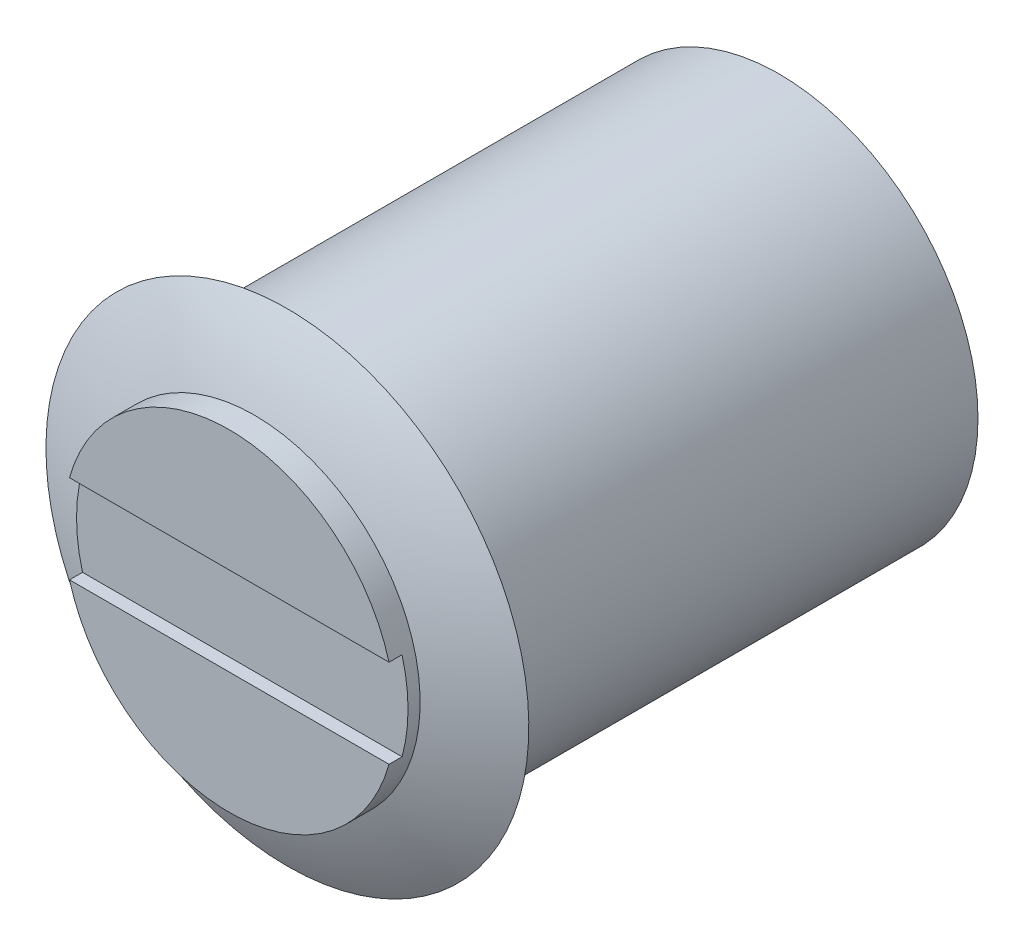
ISO-10303-21;
HEADER;
FILE_DESCRIPTION(('STEP AP214'),'2;1');
FILE_NAME('part.step','',(''),(''),'','','');
FILE_SCHEMA(('AUTOMOTIVE_DESIGN { 1 0 10303 214 1 1 1 1 }'));
ENDSEC;
DATA;
#1=APPLICATION_CONTEXT('core data for automotive mechanical design processes');
#2=APPLICATION_PROTOCOL_DEFINITION('international standard','automotive_design',2000,#1);
#3=PRODUCT_CONTEXT('',#1,'mechanical');
#4=PRODUCT('Part','Part','',(#3));
#5=PRODUCT_RELATED_PRODUCT_CATEGORY('part','',(#4));
#6=PRODUCT_DEFINITION_FORMATION('','',#4);
#7=PRODUCT_DEFINITION_CONTEXT('part definition',#1,'design');
#8=PRODUCT_DEFINITION('design','',#6,#7);
#9=PRODUCT_DEFINITION_SHAPE('','',#8);
#10=(LENGTH_UNIT() NAMED_UNIT(*) SI_UNIT(.MILLI.,.METRE.));
#11=(NAMED_UNIT(*) PLANE_ANGLE_UNIT() SI_UNIT($,.RADIAN.));
#12=(NAMED_UNIT(*) SI_UNIT($,.STERADIAN.) SOLID_ANGLE_UNIT());
#13=UNCERTAINTY_MEASURE_WITH_UNIT(LENGTH_MEASURE(1.E-05),#10,'distance_accuracy_value','');
#14=(GEOMETRIC_REPRESENTATION_CONTEXT(3) GLOBAL_UNCERTAINTY_ASSIGNED_CONTEXT((#13)) GLOBAL_UNIT_ASSIGNED_CONTEXT((#10,
#11,#12)) REPRESENTATION_CONTEXT('',''));
#15=CARTESIAN_POINT('',(0.,0.,0.));
#16=DIRECTION('',(0.,0.,1.));
#17=DIRECTION('',(1.,0.,0.));
#18=AXIS2_PLACEMENT_3D('',#15,#16,#17);
#19=CARTESIAN_POINT('',(0.,0.,24.88));
#20=DIRECTION('',(0.,0.,1.));
#21=DIRECTION('',(1.,0.,0.));
#22=AXIS2_PLACEMENT_3D('',#19,#20,#21);
#23=PLANE('',#22);
#24=DIRECTION('',(1.,0.,0.));
#25=VECTOR('',#24,1.);
#26=CARTESIAN_POINT('',(0.,-2.,24.88));
#27=LINE('',#26,#25);
#28=CARTESIAN_POINT('',(7.22841614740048,-2.,24.88));
#29=VERTEX_POINT('',#28);
#30=CARTESIAN_POINT('',(-7.22841614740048,-2.,24.88));
#31=VERTEX_POINT('',#30);
#32=EDGE_CURVE('E55',#29,#31,#27,.F.);
#33=ORIENTED_EDGE('',*,*,#32,.T.);
#34=CARTESIAN_POINT('',(0.,0.,24.88));
#35=DIRECTION('',(0.,0.,-1.));
#36=DIRECTION('',(-1.,0.,0.));
#37=AXIS2_PLACEMENT_3D('',#34,#35,#36);
#38=CIRCLE('',#37,7.5);
#39=EDGE_CURVE('E20',#29,#31,#38,.T.);
#40=ORIENTED_EDGE('',*,*,#39,.F.);
#41=EDGE_LOOP('',(#33,#40));
#42=FACE_BOUND('',#41,.T.);
#43=ADVANCED_FACE('F16',(#42),#23,.T.);
#44=CARTESIAN_POINT('',(0.,-2.,24.2909693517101));
#45=DIRECTION('',(0.,-1.,0.));
#46=DIRECTION('',(0.,0.,-1.));
#47=AXIS2_PLACEMENT_3D('',#44,#45,#46);
#48=PLANE('',#47);
#49=DIRECTION('',(-1.,0.,0.));
#50=VECTOR('',#49,1.);
#51=CARTESIAN_POINT('',(0.,-2.,24.2909693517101));
#52=LINE('',#51,#50);
#53=CARTESIAN_POINT('',(7.22841614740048,-2.,24.2909693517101));
#54=VERTEX_POINT('',#53);
#55=CARTESIAN_POINT('',(-7.22841614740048,-2.,24.2909693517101));
#56=VERTEX_POINT('',#55);
#57=EDGE_CURVE('E66',#54,#56,#52,.T.);
#58=ORIENTED_EDGE('',*,*,#57,.T.);
#59=DIRECTION('',(0.,0.,-1.));
#60=VECTOR('',#59,1.);
#61=CARTESIAN_POINT('',(-7.22841614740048,-2.,24.88));
#62=LINE('',#61,#60);
#63=EDGE_CURVE('E63',#31,#56,#62,.T.);
#64=ORIENTED_EDGE('',*,*,#63,.F.);
#65=ORIENTED_EDGE('',*,*,#32,.F.);
#66=DIRECTION('',(0.,0.,-1.));
#67=VECTOR('',#66,1.);
#68=CARTESIAN_POINT('',(7.22841614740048,-2.,24.88));
#69=LINE('',#68,#67);
#70=EDGE_CURVE('E75',#54,#29,#69,.F.);
#71=ORIENTED_EDGE('',*,*,#70,.F.);
#72=EDGE_LOOP('',(#58,#64,#65,#71));
#73=FACE_BOUND('',#72,.T.);
#74=ADVANCED_FACE('F64',(#73),#48,.F.);
#75=CARTESIAN_POINT('',(0.,0.,24.88));
#76=DIRECTION('',(0.,0.,1.));
#77=DIRECTION('',(1.,0.,0.));
#78=AXIS2_PLACEMENT_3D('',#75,#76,#77);
#79=PLANE('',#78);
#80=DIRECTION('',(1.,0.,0.));
#81=VECTOR('',#80,1.);
#82=CARTESIAN_POINT('',(0.,2.,24.88));
#83=LINE('',#82,#81);
#84=CARTESIAN_POINT('',(-7.22841614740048,2.,24.88));
#85=VERTEX_POINT('',#84);
#86=CARTESIAN_POINT('',(7.22841614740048,2.,24.88));
#87=VERTEX_POINT('',#86);
#88=EDGE_CURVE('E60',#85,#87,#83,.T.);
#89=ORIENTED_EDGE('',*,*,#88,.T.);
#90=CARTESIAN_POINT('',(0.,0.,24.88));
#91=DIRECTION('',(0.,0.,-1.));
#92=DIRECTION('',(-1.,0.,0.));
#93=AXIS2_PLACEMENT_3D('',#90,#91,#92);
#94=CIRCLE('',#93,7.5);
#95=EDGE_CURVE('E85',#85,#87,#94,.T.);
#96=ORIENTED_EDGE('',*,*,#95,.F.);
#97=EDGE_LOOP('',(#89,#96));
#98=FACE_BOUND('',#97,.T.);
#99=ADVANCED_FACE('F101',(#98),#79,.T.);
#100=CARTESIAN_POINT('',(0.,2.,24.88));
#101=DIRECTION('',(0.,1.,0.));
#102=DIRECTION('',(0.,0.,1.));
#103=AXIS2_PLACEMENT_3D('',#100,#101,#102);
#104=PLANE('',#103);
#105=ORIENTED_EDGE('',*,*,#88,.F.);
#106=DIRECTION('',(0.,0.,-1.));
#107=VECTOR('',#106,1.);
#108=CARTESIAN_POINT('',(-7.22841614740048,2.,24.88));
#109=LINE('',#108,#107);
#110=CARTESIAN_POINT('',(-7.22841614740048,2.,24.2909693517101));
#111=VERTEX_POINT('',#110);
#112=EDGE_CURVE('E83',#111,#85,#109,.F.);
#113=ORIENTED_EDGE('',*,*,#112,.F.);
#114=DIRECTION('',(-1.,0.,0.));
#115=VECTOR('',#114,1.);
#116=CARTESIAN_POINT('',(0.,2.,24.2909693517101));
#117=LINE('',#116,#115);
#118=CARTESIAN_POINT('',(7.22841614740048,2.,24.2909693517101));
#119=VERTEX_POINT('',#118);
#120=EDGE_CURVE('E35',#111,#119,#117,.F.);
#121=ORIENTED_EDGE('',*,*,#120,.T.);
#122=DIRECTION('',(0.,0.,-1.));
#123=VECTOR('',#122,1.);
#124=CARTESIAN_POINT('',(7.22841614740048,2.,24.88));
#125=LINE('',#124,#123);
#126=EDGE_CURVE('E80',#87,#119,#125,.T.);
#127=ORIENTED_EDGE('',*,*,#126,.F.);
#128=EDGE_LOOP('',(#105,#113,#121,#127));
#129=FACE_BOUND('',#128,.T.);
#130=ADVANCED_FACE('F98',(#129),#104,.F.);
#131=CARTESIAN_POINT('',(0.,2.,24.2909693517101));
#132=DIRECTION('',(0.,0.,-1.));
#133=DIRECTION('',(-1.,0.,0.));
#134=AXIS2_PLACEMENT_3D('',#131,#132,#133);
#135=PLANE('',#134);
#136=ORIENTED_EDGE('',*,*,#120,.F.);
#137=CARTESIAN_POINT('',(0.,0.,24.2909693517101));
#138=DIRECTION('',(0.,0.,-1.));
#139=DIRECTION('',(-1.,0.,0.));
#140=AXIS2_PLACEMENT_3D('',#137,#138,#139);
#141=CIRCLE('',#140,7.5);
#142=EDGE_CURVE('E70',#56,#111,#141,.T.);
#143=ORIENTED_EDGE('',*,*,#142,.F.);
#144=ORIENTED_EDGE('',*,*,#57,.F.);
#145=CARTESIAN_POINT('',(0.,0.,24.2909693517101));
#146=DIRECTION('',(0.,0.,-1.));
#147=DIRECTION('',(-1.,0.,0.));
#148=AXIS2_PLACEMENT_3D('',#145,#146,#147);
#149=CIRCLE('',#148,7.5);
#150=EDGE_CURVE('E93',#119,#54,#149,.T.);
#151=ORIENTED_EDGE('',*,*,#150,.F.);
#152=EDGE_LOOP('',(#136,#143,#144,#151));
#153=FACE_BOUND('',#152,.T.);
#154=ADVANCED_FACE('F97',(#153),#135,.F.);
#155=CARTESIAN_POINT('',(0.,0.,24.88));
#156=DIRECTION('',(0.,0.,-1.));
#157=DIRECTION('',(-1.,0.,0.));
#158=AXIS2_PLACEMENT_3D('',#155,#156,#157);
#159=CYLINDRICAL_SURFACE('',#158,7.5);
#160=CARTESIAN_POINT('',(0.,0.,23.7429137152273));
#161=DIRECTION('',(0.,0.,-1.));
#162=DIRECTION('',(0.,1.,0.));
#163=AXIS2_PLACEMENT_3D('',#160,#161,#162);
#164=CIRCLE('',#163,7.5);
#165=CARTESIAN_POINT('',(0.,7.5,23.7429137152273));
#166=VERTEX_POINT('',#165);
#167=EDGE_CURVE('E92',#166,#166,#164,.T.);
#168=ORIENTED_EDGE('',*,*,#167,.F.);
#169=EDGE_LOOP('',(#168));
#170=FACE_BOUND('',#169,.T.);
#171=ORIENTED_EDGE('',*,*,#126,.T.);
#172=ORIENTED_EDGE('',*,*,#150,.T.);
#173=ORIENTED_EDGE('',*,*,#70,.T.);
#174=ORIENTED_EDGE('',*,*,#39,.T.);
#175=ORIENTED_EDGE('',*,*,#63,.T.);
#176=ORIENTED_EDGE('',*,*,#142,.T.);
#177=ORIENTED_EDGE('',*,*,#112,.T.);
#178=ORIENTED_EDGE('',*,*,#95,.T.);
#179=EDGE_LOOP('',(#171,#172,#173,#174,#175,#176,#177,#178));
#180=FACE_BOUND('',#179,.T.);
#181=ADVANCED_FACE('F73',(#170,#180),#159,.T.);
#182=CARTESIAN_POINT('',(0.,0.,3.38191865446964));
#183=DIRECTION('',(0.,0.,1.));
#184=DIRECTION('',(0.,-1.,0.));
#185=AXIS2_PLACEMENT_3D('',#182,#183,#184);
#186=DEGENERATE_TOROIDAL_SURFACE('',#185,0.662773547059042,21.4783096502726,.T.);
#187=CARTESIAN_POINT('',(0.,0.,22.25));
#188=DIRECTION('',(0.,0.,1.));
#189=DIRECTION('',(0.,-1.,0.));
#190=AXIS2_PLACEMENT_3D('',#187,#188,#189);
#191=CIRCLE('',#190,10.925);
#192=CARTESIAN_POINT('',(0.,-10.925,22.25));
#193=VERTEX_POINT('',#192);
#194=EDGE_CURVE('E89',#193,#193,#191,.F.);
#195=ORIENTED_EDGE('',*,*,#194,.F.);
#196=EDGE_LOOP('',(#195));
#197=FACE_BOUND('',#196,.T.);
#198=ORIENTED_EDGE('',*,*,#167,.T.);
#199=EDGE_LOOP('',(#198));
#200=FACE_BOUND('',#199,.T.);
#201=ADVANCED_FACE('F18',(#197,#200),#186,.T.);
#202=CARTESIAN_POINT('',(0.,5.4625,22.25));
#203=DIRECTION('',(0.,0.,-1.));
#204=DIRECTION('',(-1.,0.,0.));
#205=AXIS2_PLACEMENT_3D('',#202,#203,#204);
#206=PLANE('',#205);
#207=CARTESIAN_POINT('',(0.,0.,22.25));
#208=DIRECTION('',(0.,0.,1.));
#209=DIRECTION('',(1.,0.,0.));
#210=AXIS2_PLACEMENT_3D('',#207,#208,#209);
#211=CIRCLE('',#210,9.);
#212=CARTESIAN_POINT('',(9.,0.,22.25));
#213=VERTEX_POINT('',#212);
#214=EDGE_CURVE('E26',#213,#213,#211,.F.);
#215=ORIENTED_EDGE('',*,*,#214,.F.);
#216=EDGE_LOOP('',(#215));
#217=FACE_BOUND('',#216,.T.);
#218=ORIENTED_EDGE('',*,*,#194,.T.);
#219=EDGE_LOOP('',(#218));
#220=FACE_BOUND('',#219,.T.);
#221=ADVANCED_FACE('F121',(#217,#220),#206,.T.);
#222=CARTESIAN_POINT('',(0.,0.,0.));
#223=DIRECTION('',(0.,0.,-1.));
#224=DIRECTION('',(-1.,0.,0.));
#225=AXIS2_PLACEMENT_3D('',#222,#223,#224);
#226=PLANE('',#225);
#227=CARTESIAN_POINT('',(0.,0.,0.));
#228=DIRECTION('',(0.,0.,1.));
#229=DIRECTION('',(1.,0.,0.));
#230=AXIS2_PLACEMENT_3D('',#227,#228,#229);
#231=CIRCLE('',#230,9.);
#232=CARTESIAN_POINT('',(9.,0.,0.));
#233=VERTEX_POINT('',#232);
#234=EDGE_CURVE('E11',#233,#233,#231,.T.);
#235=ORIENTED_EDGE('',*,*,#234,.F.);
#236=EDGE_LOOP('',(#235));
#237=FACE_BOUND('',#236,.T.);
#238=ADVANCED_FACE('F114',(#237),#226,.T.);
#239=CARTESIAN_POINT('',(0.,0.,0.));
#240=DIRECTION('',(0.,0.,1.));
#241=DIRECTION('',(1.,0.,0.));
#242=AXIS2_PLACEMENT_3D('',#239,#240,#241);
#243=CYLINDRICAL_SURFACE('',#242,9.);
#244=ORIENTED_EDGE('',*,*,#234,.T.);
#245=EDGE_LOOP('',(#244));
#246=FACE_BOUND('',#245,.T.);
#247=ORIENTED_EDGE('',*,*,#214,.T.);
#248=EDGE_LOOP('',(#247));
#249=FACE_BOUND('',#248,.T.);
#250=ADVANCED_FACE('F112',(#246,#249),#243,.T.);
#251=CLOSED_SHELL('',(#43,#74,#99,#130,#154,#181,#201,#221,#238,#250));
#252=MANIFOLD_SOLID_BREP('B1',#251);
#253=ADVANCED_BREP_SHAPE_REPRESENTATION('',(#18,#252),#14);
#254=SHAPE_DEFINITION_REPRESENTATION(#9,#253);
ENDSEC;
END-ISO-10303-21;
